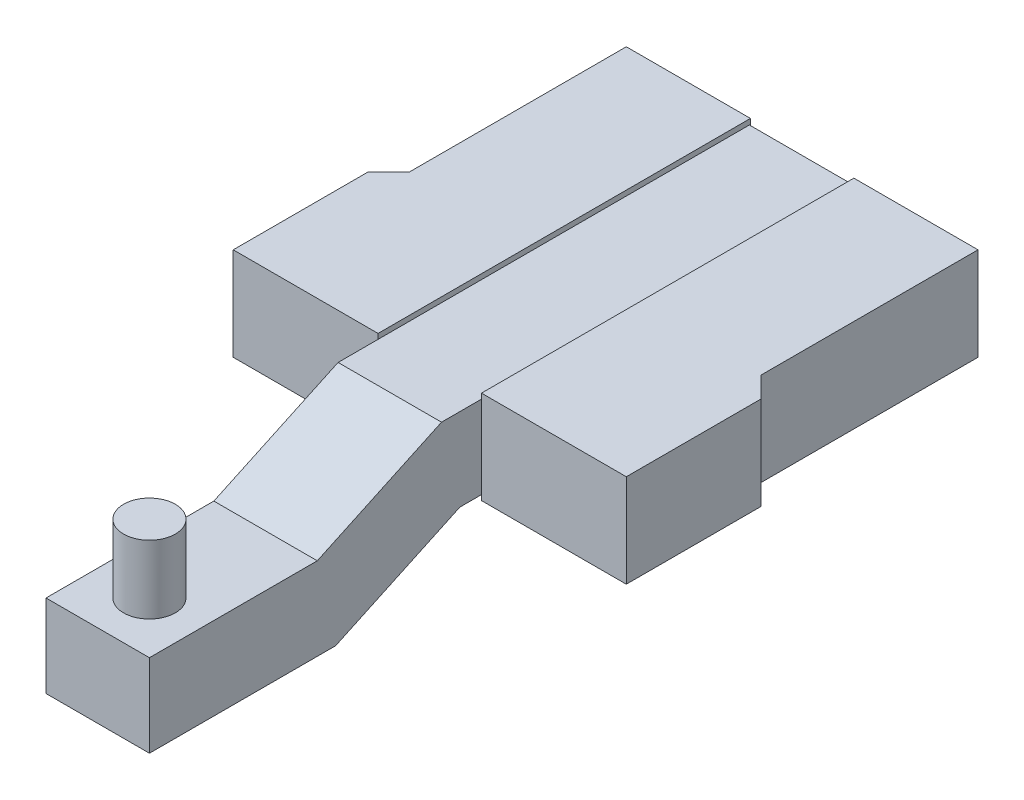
ISO-10303-21;
HEADER;
FILE_DESCRIPTION(('STEP AP214'),'2;1');
FILE_NAME('part.step','',(''),(''),'','','');
FILE_SCHEMA(('AUTOMOTIVE_DESIGN { 1 0 10303 214 1 1 1 1 }'));
ENDSEC;
DATA;
#1=APPLICATION_CONTEXT('core data for automotive mechanical design processes');
#2=APPLICATION_PROTOCOL_DEFINITION('international standard','automotive_design',2000,#1);
#3=PRODUCT_CONTEXT('',#1,'mechanical');
#4=PRODUCT('Part','Part','',(#3));
#5=PRODUCT_RELATED_PRODUCT_CATEGORY('part','',(#4));
#6=PRODUCT_DEFINITION_FORMATION('','',#4);
#7=PRODUCT_DEFINITION_CONTEXT('part definition',#1,'design');
#8=PRODUCT_DEFINITION('design','',#6,#7);
#9=PRODUCT_DEFINITION_SHAPE('','',#8);
#10=(LENGTH_UNIT() NAMED_UNIT(*) SI_UNIT(.MILLI.,.METRE.));
#11=(NAMED_UNIT(*) PLANE_ANGLE_UNIT() SI_UNIT($,.RADIAN.));
#12=(NAMED_UNIT(*) SI_UNIT($,.STERADIAN.) SOLID_ANGLE_UNIT());
#13=UNCERTAINTY_MEASURE_WITH_UNIT(LENGTH_MEASURE(1.E-05),#10,'distance_accuracy_value','');
#14=(GEOMETRIC_REPRESENTATION_CONTEXT(3) GLOBAL_UNCERTAINTY_ASSIGNED_CONTEXT((#13)) GLOBAL_UNIT_ASSIGNED_CONTEXT((#10,
#11,#12)) REPRESENTATION_CONTEXT('',''));
#15=CARTESIAN_POINT('',(0.,0.,0.));
#16=DIRECTION('',(0.,0.,1.));
#17=DIRECTION('',(1.,0.,0.));
#18=AXIS2_PLACEMENT_3D('',#15,#16,#17);
#19=CARTESIAN_POINT('',(25.,40.,-100.));
#20=DIRECTION('',(0.,-1.,0.));
#21=DIRECTION('',(0.,0.,-1.));
#22=AXIS2_PLACEMENT_3D('',#19,#20,#21);
#23=PLANE('',#22);
#24=DIRECTION('',(-1.,0.,0.));
#25=VECTOR('',#24,1.);
#26=CARTESIAN_POINT('',(25.,40.,-181.132213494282));
#27=LINE('',#26,#25);
#28=CARTESIAN_POINT('',(25.,40.,-181.132213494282));
#29=VERTEX_POINT('',#28);
#30=CARTESIAN_POINT('',(-25.,40.,-181.132213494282));
#31=VERTEX_POINT('',#30);
#32=EDGE_CURVE('E317',#29,#31,#27,.T.);
#33=ORIENTED_EDGE('',*,*,#32,.T.);
#34=DIRECTION('',(0.,0.,1.));
#35=VECTOR('',#34,1.);
#36=CARTESIAN_POINT('',(-25.,40.,-100.));
#37=LINE('',#36,#35);
#38=CARTESIAN_POINT('',(-25.,40.,-100.));
#39=VERTEX_POINT('',#38);
#40=EDGE_CURVE('E270',#31,#39,#37,.T.);
#41=ORIENTED_EDGE('',*,*,#40,.T.);
#42=DIRECTION('',(-1.,0.,0.));
#43=VECTOR('',#42,1.);
#44=CARTESIAN_POINT('',(25.,40.,-100.));
#45=LINE('',#44,#43);
#46=CARTESIAN_POINT('',(25.,40.,-100.));
#47=VERTEX_POINT('',#46);
#48=EDGE_CURVE('E333',#47,#39,#45,.T.);
#49=ORIENTED_EDGE('',*,*,#48,.F.);
#50=DIRECTION('',(0.,0.,1.));
#51=VECTOR('',#50,1.);
#52=CARTESIAN_POINT('',(25.,40.,-100.));
#53=LINE('',#52,#51);
#54=EDGE_CURVE('E296',#29,#47,#53,.T.);
#55=ORIENTED_EDGE('',*,*,#54,.F.);
#56=EDGE_LOOP('',(#33,#41,#49,#55));
#57=FACE_BOUND('',#56,.T.);
#58=CARTESIAN_POINT('',(0.,40.,-125.));
#59=DIRECTION('',(0.,-1.,0.));
#60=DIRECTION('',(0.,0.,-1.));
#61=AXIS2_PLACEMENT_3D('',#58,#59,#60);
#62=CIRCLE('',#61,12.4999999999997);
#63=CARTESIAN_POINT('',(0.,40.,-137.5));
#64=VERTEX_POINT('',#63);
#65=EDGE_CURVE('E10',#64,#64,#62,.F.);
#66=ORIENTED_EDGE('',*,*,#65,.F.);
#67=EDGE_LOOP('',(#66));
#68=FACE_BOUND('',#67,.T.);
#69=ADVANCED_FACE('F15',(#57,#68),#23,.F.);
#70=CARTESIAN_POINT('',(25.,40.,-440.));
#71=DIRECTION('',(-1.,0.,0.));
#72=DIRECTION('',(0.,0.,1.));
#73=AXIS2_PLACEMENT_3D('',#70,#71,#72);
#74=PLANE('',#73);
#75=DIRECTION('',(0.,-1.,0.));
#76=VECTOR('',#75,1.);
#77=CARTESIAN_POINT('',(25.,70.5,-260.5));
#78=LINE('',#77,#76);
#79=CARTESIAN_POINT('',(25.,68.,-260.5));
#80=VERTEX_POINT('',#79);
#81=CARTESIAN_POINT('',(25.,28.,-260.5));
#82=VERTEX_POINT('',#81);
#83=EDGE_CURVE('E22',#80,#82,#78,.T.);
#84=ORIENTED_EDGE('',*,*,#83,.F.);
#85=DIRECTION('',(0.,0.,1.));
#86=VECTOR('',#85,1.);
#87=CARTESIAN_POINT('',(25.,68.,-241.178407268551));
#88=LINE('',#87,#86);
#89=CARTESIAN_POINT('',(25.,68.,-241.178407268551));
#90=VERTEX_POINT('',#89);
#91=EDGE_CURVE('E311',#80,#90,#88,.T.);
#92=ORIENTED_EDGE('',*,*,#91,.T.);
#93=DIRECTION('',(0.,-0.422618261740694,0.906307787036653));
#94=VECTOR('',#93,1.);
#95=CARTESIAN_POINT('',(25.,40.,-181.132213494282));
#96=LINE('',#95,#94);
#97=EDGE_CURVE('E315',#90,#29,#96,.T.);
#98=ORIENTED_EDGE('',*,*,#97,.T.);
#99=ORIENTED_EDGE('',*,*,#54,.T.);
#100=DIRECTION('',(0.,-1.,0.));
#101=VECTOR('',#100,1.);
#102=CARTESIAN_POINT('',(25.,40.,-100.));
#103=LINE('',#102,#101);
#104=CARTESIAN_POINT('',(25.,0.,-100.));
#105=VERTEX_POINT('',#104);
#106=EDGE_CURVE('E299',#47,#105,#103,.T.);
#107=ORIENTED_EDGE('',*,*,#106,.T.);
#108=DIRECTION('',(0.,0.,-1.));
#109=VECTOR('',#108,1.);
#110=CARTESIAN_POINT('',(25.,0.,-100.));
#111=LINE('',#110,#109);
#112=CARTESIAN_POINT('',(25.,0.,-190.));
#113=VERTEX_POINT('',#112);
#114=EDGE_CURVE('E301',#105,#113,#111,.T.);
#115=ORIENTED_EDGE('',*,*,#114,.T.);
#116=DIRECTION('',(0.,0.422618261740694,-0.906307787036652));
#117=VECTOR('',#116,1.);
#118=CARTESIAN_POINT('',(25.,28.,-250.046193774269));
#119=LINE('',#118,#117);
#120=CARTESIAN_POINT('',(25.,28.,-250.046193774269));
#121=VERTEX_POINT('',#120);
#122=EDGE_CURVE('E303',#113,#121,#119,.T.);
#123=ORIENTED_EDGE('',*,*,#122,.T.);
#124=DIRECTION('',(0.,0.,-1.));
#125=VECTOR('',#124,1.);
#126=CARTESIAN_POINT('',(25.,28.,-440.));
#127=LINE('',#126,#125);
#128=EDGE_CURVE('E306',#121,#82,#127,.T.);
#129=ORIENTED_EDGE('',*,*,#128,.T.);
#130=EDGE_LOOP('',(#84,#92,#98,#99,#107,#115,#123,#129));
#131=FACE_BOUND('',#130,.T.);
#132=ADVANCED_FACE('F386',(#131),#74,.F.);
#133=CARTESIAN_POINT('',(-25.,40.,-440.));
#134=DIRECTION('',(-1.,0.,0.));
#135=DIRECTION('',(0.,0.,1.));
#136=AXIS2_PLACEMENT_3D('',#133,#134,#135);
#137=PLANE('',#136);
#138=DIRECTION('',(0.,0.,1.));
#139=VECTOR('',#138,1.);
#140=CARTESIAN_POINT('',(-25.,68.,-241.178407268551));
#141=LINE('',#140,#139);
#142=CARTESIAN_POINT('',(-25.,68.,-260.5));
#143=VERTEX_POINT('',#142);
#144=CARTESIAN_POINT('',(-25.,68.,-241.178407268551));
#145=VERTEX_POINT('',#144);
#146=EDGE_CURVE('E289',#143,#145,#141,.T.);
#147=ORIENTED_EDGE('',*,*,#146,.F.);
#148=DIRECTION('',(0.,-1.,0.));
#149=VECTOR('',#148,1.);
#150=CARTESIAN_POINT('',(-25.,70.5,-260.5));
#151=LINE('',#150,#149);
#152=CARTESIAN_POINT('',(-25.,28.,-260.5));
#153=VERTEX_POINT('',#152);
#154=EDGE_CURVE('E262',#143,#153,#151,.T.);
#155=ORIENTED_EDGE('',*,*,#154,.T.);
#156=DIRECTION('',(0.,0.,-1.));
#157=VECTOR('',#156,1.);
#158=CARTESIAN_POINT('',(-25.,28.,-440.));
#159=LINE('',#158,#157);
#160=CARTESIAN_POINT('',(-25.,28.,-250.046193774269));
#161=VERTEX_POINT('',#160);
#162=EDGE_CURVE('E283',#161,#153,#159,.T.);
#163=ORIENTED_EDGE('',*,*,#162,.F.);
#164=DIRECTION('',(0.,0.422618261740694,-0.906307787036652));
#165=VECTOR('',#164,1.);
#166=CARTESIAN_POINT('',(-25.,28.,-250.046193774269));
#167=LINE('',#166,#165);
#168=CARTESIAN_POINT('',(-25.,0.,-190.));
#169=VERTEX_POINT('',#168);
#170=EDGE_CURVE('E279',#169,#161,#167,.T.);
#171=ORIENTED_EDGE('',*,*,#170,.F.);
#172=DIRECTION('',(0.,0.,-1.));
#173=VECTOR('',#172,1.);
#174=CARTESIAN_POINT('',(-25.,0.,-100.));
#175=LINE('',#174,#173);
#176=CARTESIAN_POINT('',(-25.,0.,-100.));
#177=VERTEX_POINT('',#176);
#178=EDGE_CURVE('E276',#177,#169,#175,.T.);
#179=ORIENTED_EDGE('',*,*,#178,.F.);
#180=DIRECTION('',(0.,-1.,0.));
#181=VECTOR('',#180,1.);
#182=CARTESIAN_POINT('',(-25.,40.,-100.));
#183=LINE('',#182,#181);
#184=EDGE_CURVE('E273',#39,#177,#183,.T.);
#185=ORIENTED_EDGE('',*,*,#184,.F.);
#186=ORIENTED_EDGE('',*,*,#40,.F.);
#187=DIRECTION('',(0.,-0.422618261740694,0.906307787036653));
#188=VECTOR('',#187,1.);
#189=CARTESIAN_POINT('',(-25.,40.,-181.132213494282));
#190=LINE('',#189,#188);
#191=EDGE_CURVE('E293',#145,#31,#190,.T.);
#192=ORIENTED_EDGE('',*,*,#191,.F.);
#193=EDGE_LOOP('',(#147,#155,#163,#171,#179,#185,#186,#192));
#194=FACE_BOUND('',#193,.T.);
#195=ADVANCED_FACE('F392',(#194),#137,.T.);
#196=CARTESIAN_POINT('',(25.,40.,-100.));
#197=DIRECTION('',(0.,0.,-1.));
#198=DIRECTION('',(0.,1.,0.));
#199=AXIS2_PLACEMENT_3D('',#196,#197,#198);
#200=PLANE('',#199);
#201=ORIENTED_EDGE('',*,*,#48,.T.);
#202=ORIENTED_EDGE('',*,*,#184,.T.);
#203=DIRECTION('',(-1.,0.,0.));
#204=VECTOR('',#203,1.);
#205=CARTESIAN_POINT('',(25.,0.,-100.));
#206=LINE('',#205,#204);
#207=EDGE_CURVE('E332',#105,#177,#206,.T.);
#208=ORIENTED_EDGE('',*,*,#207,.F.);
#209=ORIENTED_EDGE('',*,*,#106,.F.);
#210=EDGE_LOOP('',(#201,#202,#208,#209));
#211=FACE_BOUND('',#210,.T.);
#212=ADVANCED_FACE('F619',(#211),#200,.F.);
#213=CARTESIAN_POINT('',(25.,0.,-100.));
#214=DIRECTION('',(0.,1.,0.));
#215=DIRECTION('',(0.,0.,1.));
#216=AXIS2_PLACEMENT_3D('',#213,#214,#215);
#217=PLANE('',#216);
#218=ORIENTED_EDGE('',*,*,#207,.T.);
#219=ORIENTED_EDGE('',*,*,#178,.T.);
#220=DIRECTION('',(-1.,0.,0.));
#221=VECTOR('',#220,1.);
#222=CARTESIAN_POINT('',(25.,0.,-190.));
#223=LINE('',#222,#221);
#224=EDGE_CURVE('E330',#113,#169,#223,.T.);
#225=ORIENTED_EDGE('',*,*,#224,.F.);
#226=ORIENTED_EDGE('',*,*,#114,.F.);
#227=EDGE_LOOP('',(#218,#219,#225,#226));
#228=FACE_BOUND('',#227,.T.);
#229=ADVANCED_FACE('F610',(#228),#217,.F.);
#230=CARTESIAN_POINT('',(25.,28.,-250.046193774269));
#231=DIRECTION('',(0.,0.906307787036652,0.422618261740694));
#232=DIRECTION('',(0.,-0.422618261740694,0.906307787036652));
#233=AXIS2_PLACEMENT_3D('',#230,#231,#232);
#234=PLANE('',#233);
#235=ORIENTED_EDGE('',*,*,#224,.T.);
#236=ORIENTED_EDGE('',*,*,#170,.T.);
#237=DIRECTION('',(-1.,0.,0.));
#238=VECTOR('',#237,1.);
#239=CARTESIAN_POINT('',(25.,28.,-250.046193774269));
#240=LINE('',#239,#238);
#241=EDGE_CURVE('E328',#121,#161,#240,.T.);
#242=ORIENTED_EDGE('',*,*,#241,.F.);
#243=ORIENTED_EDGE('',*,*,#122,.F.);
#244=EDGE_LOOP('',(#235,#236,#242,#243));
#245=FACE_BOUND('',#244,.T.);
#246=ADVANCED_FACE('F601',(#245),#234,.F.);
#247=CARTESIAN_POINT('',(25.,28.,-440.));
#248=DIRECTION('',(0.,1.,0.));
#249=DIRECTION('',(0.,0.,1.));
#250=AXIS2_PLACEMENT_3D('',#247,#248,#249);
#251=PLANE('',#250);
#252=ORIENTED_EDGE('',*,*,#241,.T.);
#253=ORIENTED_EDGE('',*,*,#162,.T.);
#254=CARTESIAN_POINT('',(-25.,28.,-440.));
#255=VERTEX_POINT('',#254);
#256=EDGE_CURVE('E282',#153,#255,#159,.T.);
#257=ORIENTED_EDGE('',*,*,#256,.T.);
#258=DIRECTION('',(-1.,0.,0.));
#259=VECTOR('',#258,1.);
#260=CARTESIAN_POINT('',(25.,28.,-440.));
#261=LINE('',#260,#259);
#262=CARTESIAN_POINT('',(25.,28.,-440.));
#263=VERTEX_POINT('',#262);
#264=EDGE_CURVE('E325',#263,#255,#261,.T.);
#265=ORIENTED_EDGE('',*,*,#264,.F.);
#266=EDGE_CURVE('E305',#82,#263,#127,.T.);
#267=ORIENTED_EDGE('',*,*,#266,.F.);
#268=ORIENTED_EDGE('',*,*,#128,.F.);
#269=EDGE_LOOP('',(#252,#253,#257,#265,#267,#268));
#270=FACE_BOUND('',#269,.T.);
#271=ADVANCED_FACE('F592',(#270),#251,.F.);
#272=CARTESIAN_POINT('',(25.,68.,-440.));
#273=DIRECTION('',(0.,0.,1.));
#274=DIRECTION('',(1.,0.,0.));
#275=AXIS2_PLACEMENT_3D('',#272,#273,#274);
#276=PLANE('',#275);
#277=ORIENTED_EDGE('',*,*,#264,.T.);
#278=DIRECTION('',(0.,1.,0.));
#279=VECTOR('',#278,1.);
#280=CARTESIAN_POINT('',(-25.,68.,-440.));
#281=LINE('',#280,#279);
#282=CARTESIAN_POINT('',(-25.,68.,-440.));
#283=VERTEX_POINT('',#282);
#284=EDGE_CURVE('E286',#255,#283,#281,.T.);
#285=ORIENTED_EDGE('',*,*,#284,.T.);
#286=DIRECTION('',(-1.,0.,0.));
#287=VECTOR('',#286,1.);
#288=CARTESIAN_POINT('',(25.,68.,-440.));
#289=LINE('',#288,#287);
#290=CARTESIAN_POINT('',(25.,68.,-440.));
#291=VERTEX_POINT('',#290);
#292=EDGE_CURVE('E322',#291,#283,#289,.T.);
#293=ORIENTED_EDGE('',*,*,#292,.F.);
#294=DIRECTION('',(0.,1.,0.));
#295=VECTOR('',#294,1.);
#296=CARTESIAN_POINT('',(25.,68.,-440.));
#297=LINE('',#296,#295);
#298=EDGE_CURVE('E308',#263,#291,#297,.T.);
#299=ORIENTED_EDGE('',*,*,#298,.F.);
#300=EDGE_LOOP('',(#277,#285,#293,#299));
#301=FACE_BOUND('',#300,.T.);
#302=ADVANCED_FACE('F583',(#301),#276,.F.);
#303=CARTESIAN_POINT('',(25.,68.,-241.178407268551));
#304=DIRECTION('',(0.,-1.,0.));
#305=DIRECTION('',(0.,0.,-1.));
#306=AXIS2_PLACEMENT_3D('',#303,#304,#305);
#307=PLANE('',#306);
#308=ORIENTED_EDGE('',*,*,#292,.T.);
#309=EDGE_CURVE('E290',#283,#143,#141,.T.);
#310=ORIENTED_EDGE('',*,*,#309,.T.);
#311=ORIENTED_EDGE('',*,*,#146,.T.);
#312=DIRECTION('',(-1.,0.,0.));
#313=VECTOR('',#312,1.);
#314=CARTESIAN_POINT('',(25.,68.,-241.178407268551));
#315=LINE('',#314,#313);
#316=EDGE_CURVE('E319',#90,#145,#315,.T.);
#317=ORIENTED_EDGE('',*,*,#316,.F.);
#318=ORIENTED_EDGE('',*,*,#91,.F.);
#319=EDGE_CURVE('E312',#291,#80,#88,.T.);
#320=ORIENTED_EDGE('',*,*,#319,.F.);
#321=EDGE_LOOP('',(#308,#310,#311,#317,#318,#320));
#322=FACE_BOUND('',#321,.T.);
#323=ADVANCED_FACE('F575',(#322),#307,.F.);
#324=CARTESIAN_POINT('',(25.,40.,-181.132213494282));
#325=DIRECTION('',(0.,-0.906307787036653,-0.422618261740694));
#326=DIRECTION('',(0.,0.422618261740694,-0.906307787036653));
#327=AXIS2_PLACEMENT_3D('',#324,#325,#326);
#328=PLANE('',#327);
#329=ORIENTED_EDGE('',*,*,#316,.T.);
#330=ORIENTED_EDGE('',*,*,#191,.T.);
#331=ORIENTED_EDGE('',*,*,#32,.F.);
#332=ORIENTED_EDGE('',*,*,#97,.F.);
#333=EDGE_LOOP('',(#329,#330,#331,#332));
#334=FACE_BOUND('',#333,.T.);
#335=ADVANCED_FACE('F383',(#334),#328,.F.);
#336=CARTESIAN_POINT('',(-25.,70.5,-440.5));
#337=DIRECTION('',(0.,0.,1.));
#338=DIRECTION('',(1.,0.,0.));
#339=AXIS2_PLACEMENT_3D('',#336,#337,#338);
#340=PLANE('',#339);
#341=DIRECTION('',(0.,-1.,0.));
#342=VECTOR('',#341,1.);
#343=CARTESIAN_POINT('',(-25.,70.5,-440.5));
#344=LINE('',#343,#342);
#345=CARTESIAN_POINT('',(-25.,70.5,-440.5));
#346=VERTEX_POINT('',#345);
#347=CARTESIAN_POINT('',(-25.,25.5,-440.5));
#348=VERTEX_POINT('',#347);
#349=EDGE_CURVE('E256',#346,#348,#344,.T.);
#350=ORIENTED_EDGE('',*,*,#349,.T.);
#351=DIRECTION('',(-1.,0.,0.));
#352=VECTOR('',#351,1.);
#353=CARTESIAN_POINT('',(-25.,25.5,-440.5));
#354=LINE('',#353,#352);
#355=CARTESIAN_POINT('',(-85.,25.5,-440.5));
#356=VERTEX_POINT('',#355);
#357=EDGE_CURVE('E173',#348,#356,#354,.T.);
#358=ORIENTED_EDGE('',*,*,#357,.T.);
#359=DIRECTION('',(0.,-1.,0.));
#360=VECTOR('',#359,1.);
#361=CARTESIAN_POINT('',(-85.,70.5,-440.5));
#362=LINE('',#361,#360);
#363=CARTESIAN_POINT('',(-85.,70.5,-440.5));
#364=VERTEX_POINT('',#363);
#365=EDGE_CURVE('E268',#364,#356,#362,.T.);
#366=ORIENTED_EDGE('',*,*,#365,.F.);
#367=DIRECTION('',(-1.,0.,0.));
#368=VECTOR('',#367,1.);
#369=CARTESIAN_POINT('',(-25.,70.5,-440.5));
#370=LINE('',#369,#368);
#371=EDGE_CURVE('E243',#346,#364,#370,.T.);
#372=ORIENTED_EDGE('',*,*,#371,.F.);
#373=EDGE_LOOP('',(#350,#358,#366,#372));
#374=FACE_BOUND('',#373,.T.);
#375=ADVANCED_FACE('F358',(#374),#340,.F.);
#376=CARTESIAN_POINT('',(-85.,70.5,-440.5));
#377=DIRECTION('',(1.,0.,0.));
#378=DIRECTION('',(0.,0.,-1.));
#379=AXIS2_PLACEMENT_3D('',#376,#377,#378);
#380=PLANE('',#379);
#381=ORIENTED_EDGE('',*,*,#365,.T.);
#382=DIRECTION('',(0.,0.,1.));
#383=VECTOR('',#382,1.);
#384=CARTESIAN_POINT('',(-85.,25.5,-440.5));
#385=LINE('',#384,#383);
#386=CARTESIAN_POINT('',(-85.,25.5,-335.5));
#387=VERTEX_POINT('',#386);
#388=EDGE_CURVE('E229',#356,#387,#385,.T.);
#389=ORIENTED_EDGE('',*,*,#388,.T.);
#390=DIRECTION('',(0.,-1.,0.));
#391=VECTOR('',#390,1.);
#392=CARTESIAN_POINT('',(-85.,70.5,-335.5));
#393=LINE('',#392,#391);
#394=CARTESIAN_POINT('',(-85.,70.5,-335.5));
#395=VERTEX_POINT('',#394);
#396=EDGE_CURVE('E266',#395,#387,#393,.T.);
#397=ORIENTED_EDGE('',*,*,#396,.F.);
#398=DIRECTION('',(0.,0.,1.));
#399=VECTOR('',#398,1.);
#400=CARTESIAN_POINT('',(-85.,70.5,-440.5));
#401=LINE('',#400,#399);
#402=EDGE_CURVE('E246',#364,#395,#401,.T.);
#403=ORIENTED_EDGE('',*,*,#402,.F.);
#404=EDGE_LOOP('',(#381,#389,#397,#403));
#405=FACE_BOUND('',#404,.T.);
#406=ADVANCED_FACE('F373',(#405),#380,.F.);
#407=CARTESIAN_POINT('',(-85.,70.5,-335.5));
#408=DIRECTION('',(0.707106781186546,0.,0.70710678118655));
#409=DIRECTION('',(0.70710678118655,0.,-0.707106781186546));
#410=AXIS2_PLACEMENT_3D('',#407,#408,#409);
#411=PLANE('',#410);
#412=ORIENTED_EDGE('',*,*,#396,.T.);
#413=DIRECTION('',(-0.70710678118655,0.,0.707106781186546));
#414=VECTOR('',#413,1.);
#415=CARTESIAN_POINT('',(-85.,25.5,-335.5));
#416=LINE('',#415,#414);
#417=CARTESIAN_POINT('',(-95.,25.5,-325.5));
#418=VERTEX_POINT('',#417);
#419=EDGE_CURVE('E232',#387,#418,#416,.T.);
#420=ORIENTED_EDGE('',*,*,#419,.T.);
#421=DIRECTION('',(0.,-1.,0.));
#422=VECTOR('',#421,1.);
#423=CARTESIAN_POINT('',(-95.,70.5,-325.5));
#424=LINE('',#423,#422);
#425=CARTESIAN_POINT('',(-95.,70.5,-325.5));
#426=VERTEX_POINT('',#425);
#427=EDGE_CURVE('E264',#426,#418,#424,.T.);
#428=ORIENTED_EDGE('',*,*,#427,.F.);
#429=DIRECTION('',(-0.70710678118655,0.,0.707106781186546));
#430=VECTOR('',#429,1.);
#431=CARTESIAN_POINT('',(-85.,70.5,-335.5));
#432=LINE('',#431,#430);
#433=EDGE_CURVE('E248',#395,#426,#432,.T.);
#434=ORIENTED_EDGE('',*,*,#433,.F.);
#435=EDGE_LOOP('',(#412,#420,#428,#434));
#436=FACE_BOUND('',#435,.T.);
#437=ADVANCED_FACE('F370',(#436),#411,.F.);
#438=CARTESIAN_POINT('',(-95.,70.5,-325.5));
#439=DIRECTION('',(1.,0.,0.));
#440=DIRECTION('',(0.,0.,-1.));
#441=AXIS2_PLACEMENT_3D('',#438,#439,#440);
#442=PLANE('',#441);
#443=ORIENTED_EDGE('',*,*,#427,.T.);
#444=DIRECTION('',(0.,0.,1.));
#445=VECTOR('',#444,1.);
#446=CARTESIAN_POINT('',(-95.,25.5,-325.5));
#447=LINE('',#446,#445);
#448=CARTESIAN_POINT('',(-95.,25.5,-260.5));
#449=VERTEX_POINT('',#448);
#450=EDGE_CURVE('E235',#418,#449,#447,.T.);
#451=ORIENTED_EDGE('',*,*,#450,.T.);
#452=DIRECTION('',(0.,-1.,0.));
#453=VECTOR('',#452,1.);
#454=CARTESIAN_POINT('',(-95.,70.5,-260.5));
#455=LINE('',#454,#453);
#456=CARTESIAN_POINT('',(-95.,70.5,-260.5));
#457=VERTEX_POINT('',#456);
#458=EDGE_CURVE('E261',#457,#449,#455,.T.);
#459=ORIENTED_EDGE('',*,*,#458,.F.);
#460=DIRECTION('',(0.,0.,1.));
#461=VECTOR('',#460,1.);
#462=CARTESIAN_POINT('',(-95.,70.5,-325.5));
#463=LINE('',#462,#461);
#464=EDGE_CURVE('E250',#426,#457,#463,.T.);
#465=ORIENTED_EDGE('',*,*,#464,.F.);
#466=EDGE_LOOP('',(#443,#451,#459,#465));
#467=FACE_BOUND('',#466,.T.);
#468=ADVANCED_FACE('F368',(#467),#442,.F.);
#469=CARTESIAN_POINT('',(-95.,70.5,-260.5));
#470=DIRECTION('',(0.,0.,-1.));
#471=DIRECTION('',(-1.,0.,0.));
#472=AXIS2_PLACEMENT_3D('',#469,#470,#471);
#473=PLANE('',#472);
#474=ORIENTED_EDGE('',*,*,#458,.T.);
#475=DIRECTION('',(1.,0.,0.));
#476=VECTOR('',#475,1.);
#477=CARTESIAN_POINT('',(-95.,25.5,-260.5));
#478=LINE('',#477,#476);
#479=CARTESIAN_POINT('',(-25.,25.5,-260.5));
#480=VERTEX_POINT('',#479);
#481=EDGE_CURVE('E238',#449,#480,#478,.T.);
#482=ORIENTED_EDGE('',*,*,#481,.T.);
#483=EDGE_CURVE('E36',#153,#480,#151,.T.);
#484=ORIENTED_EDGE('',*,*,#483,.F.);
#485=ORIENTED_EDGE('',*,*,#154,.F.);
#486=CARTESIAN_POINT('',(-25.,70.5,-260.5));
#487=VERTEX_POINT('',#486);
#488=EDGE_CURVE('E258',#487,#143,#151,.T.);
#489=ORIENTED_EDGE('',*,*,#488,.F.);
#490=DIRECTION('',(1.,0.,0.));
#491=VECTOR('',#490,1.);
#492=CARTESIAN_POINT('',(-95.,70.5,-260.5));
#493=LINE('',#492,#491);
#494=EDGE_CURVE('E252',#457,#487,#493,.T.);
#495=ORIENTED_EDGE('',*,*,#494,.F.);
#496=EDGE_LOOP('',(#474,#482,#484,#485,#489,#495));
#497=FACE_BOUND('',#496,.T.);
#498=ADVANCED_FACE('F347',(#497),#473,.F.);
#499=CARTESIAN_POINT('',(-25.,70.5,-440.5));
#500=DIRECTION('',(-1.,0.,0.));
#501=DIRECTION('',(0.,0.,1.));
#502=AXIS2_PLACEMENT_3D('',#499,#500,#501);
#503=PLANE('',#502);
#504=ORIENTED_EDGE('',*,*,#309,.F.);
#505=ORIENTED_EDGE('',*,*,#284,.F.);
#506=ORIENTED_EDGE('',*,*,#256,.F.);
#507=ORIENTED_EDGE('',*,*,#483,.T.);
#508=DIRECTION('',(0.,0.,-1.));
#509=VECTOR('',#508,1.);
#510=CARTESIAN_POINT('',(-25.,25.5,-440.5));
#511=LINE('',#510,#509);
#512=EDGE_CURVE('E240',#480,#348,#511,.T.);
#513=ORIENTED_EDGE('',*,*,#512,.T.);
#514=ORIENTED_EDGE('',*,*,#349,.F.);
#515=DIRECTION('',(0.,0.,-1.));
#516=VECTOR('',#515,1.);
#517=CARTESIAN_POINT('',(-25.,70.5,-440.5));
#518=LINE('',#517,#516);
#519=EDGE_CURVE('E254',#487,#346,#518,.T.);
#520=ORIENTED_EDGE('',*,*,#519,.F.);
#521=ORIENTED_EDGE('',*,*,#488,.T.);
#522=EDGE_LOOP('',(#504,#505,#506,#507,#513,#514,#520,#521));
#523=FACE_BOUND('',#522,.T.);
#524=ADVANCED_FACE('F342',(#523),#503,.F.);
#525=CARTESIAN_POINT('',(-25.,70.5,-440.5));
#526=DIRECTION('',(0.,1.,0.));
#527=DIRECTION('',(0.,0.,1.));
#528=AXIS2_PLACEMENT_3D('',#525,#526,#527);
#529=PLANE('',#528);
#530=ORIENTED_EDGE('',*,*,#371,.T.);
#531=ORIENTED_EDGE('',*,*,#402,.T.);
#532=ORIENTED_EDGE('',*,*,#433,.T.);
#533=ORIENTED_EDGE('',*,*,#464,.T.);
#534=ORIENTED_EDGE('',*,*,#494,.T.);
#535=ORIENTED_EDGE('',*,*,#519,.T.);
#536=EDGE_LOOP('',(#530,#531,#532,#533,#534,#535));
#537=FACE_BOUND('',#536,.T.);
#538=ADVANCED_FACE('F363',(#537),#529,.T.);
#539=CARTESIAN_POINT('',(-25.,25.5,-440.5));
#540=DIRECTION('',(0.,1.,0.));
#541=DIRECTION('',(0.,0.,1.));
#542=AXIS2_PLACEMENT_3D('',#539,#540,#541);
#543=PLANE('',#542);
#544=ORIENTED_EDGE('',*,*,#357,.F.);
#545=ORIENTED_EDGE('',*,*,#512,.F.);
#546=ORIENTED_EDGE('',*,*,#481,.F.);
#547=ORIENTED_EDGE('',*,*,#450,.F.);
#548=ORIENTED_EDGE('',*,*,#419,.F.);
#549=ORIENTED_EDGE('',*,*,#388,.F.);
#550=EDGE_LOOP('',(#544,#545,#546,#547,#548,#549));
#551=FACE_BOUND('',#550,.T.);
#552=ADVANCED_FACE('F353',(#551),#543,.F.);
#553=CARTESIAN_POINT('',(25.,70.5,-440.5));
#554=DIRECTION('',(0.,0.,-1.));
#555=DIRECTION('',(-1.,0.,0.));
#556=AXIS2_PLACEMENT_3D('',#553,#554,#555);
#557=PLANE('',#556);
#558=DIRECTION('',(0.,-1.,0.));
#559=VECTOR('',#558,1.);
#560=CARTESIAN_POINT('',(85.,70.5,-440.5));
#561=LINE('',#560,#559);
#562=CARTESIAN_POINT('',(85.,70.5,-440.5));
#563=VERTEX_POINT('',#562);
#564=CARTESIAN_POINT('',(85.,25.5,-440.5));
#565=VERTEX_POINT('',#564);
#566=EDGE_CURVE('E187',#563,#565,#561,.T.);
#567=ORIENTED_EDGE('',*,*,#566,.T.);
#568=DIRECTION('',(1.,0.,0.));
#569=VECTOR('',#568,1.);
#570=CARTESIAN_POINT('',(25.,25.5,-440.5));
#571=LINE('',#570,#569);
#572=CARTESIAN_POINT('',(25.,25.5,-440.5));
#573=VERTEX_POINT('',#572);
#574=EDGE_CURVE('E181',#573,#565,#571,.T.);
#575=ORIENTED_EDGE('',*,*,#574,.F.);
#576=DIRECTION('',(0.,-1.,0.));
#577=VECTOR('',#576,1.);
#578=CARTESIAN_POINT('',(25.,70.5,-440.5));
#579=LINE('',#578,#577);
#580=CARTESIAN_POINT('',(25.,70.5,-440.5));
#581=VERTEX_POINT('',#580);
#582=EDGE_CURVE('E162',#581,#573,#579,.T.);
#583=ORIENTED_EDGE('',*,*,#582,.F.);
#584=DIRECTION('',(1.,0.,0.));
#585=VECTOR('',#584,1.);
#586=CARTESIAN_POINT('',(25.,70.5,-440.5));
#587=LINE('',#586,#585);
#588=EDGE_CURVE('E202',#581,#563,#587,.T.);
#589=ORIENTED_EDGE('',*,*,#588,.T.);
#590=EDGE_LOOP('',(#567,#575,#583,#589));
#591=FACE_BOUND('',#590,.T.);
#592=ADVANCED_FACE('F186',(#591),#557,.T.);
#593=CARTESIAN_POINT('',(25.,70.5,-440.5));
#594=DIRECTION('',(-1.,0.,0.));
#595=DIRECTION('',(0.,0.,1.));
#596=AXIS2_PLACEMENT_3D('',#593,#594,#595);
#597=PLANE('',#596);
#598=CARTESIAN_POINT('',(25.,25.5,-260.5));
#599=VERTEX_POINT('',#598);
#600=EDGE_CURVE('E224',#82,#599,#78,.T.);
#601=ORIENTED_EDGE('',*,*,#600,.F.);
#602=ORIENTED_EDGE('',*,*,#266,.T.);
#603=ORIENTED_EDGE('',*,*,#298,.T.);
#604=ORIENTED_EDGE('',*,*,#319,.T.);
#605=CARTESIAN_POINT('',(25.,70.5,-260.5));
#606=VERTEX_POINT('',#605);
#607=EDGE_CURVE('E174',#606,#80,#78,.T.);
#608=ORIENTED_EDGE('',*,*,#607,.F.);
#609=DIRECTION('',(0.,0.,-1.));
#610=VECTOR('',#609,1.);
#611=CARTESIAN_POINT('',(25.,70.5,-440.5));
#612=LINE('',#611,#610);
#613=EDGE_CURVE('E168',#606,#581,#612,.T.);
#614=ORIENTED_EDGE('',*,*,#613,.T.);
#615=ORIENTED_EDGE('',*,*,#582,.T.);
#616=DIRECTION('',(0.,0.,-1.));
#617=VECTOR('',#616,1.);
#618=CARTESIAN_POINT('',(25.,25.5,-440.5));
#619=LINE('',#618,#617);
#620=EDGE_CURVE('E166',#599,#573,#619,.T.);
#621=ORIENTED_EDGE('',*,*,#620,.F.);
#622=EDGE_LOOP('',(#601,#602,#603,#604,#608,#614,#615,#621));
#623=FACE_BOUND('',#622,.T.);
#624=ADVANCED_FACE('F165',(#623),#597,.T.);
#625=CARTESIAN_POINT('',(95.,70.5,-260.5));
#626=DIRECTION('',(0.,0.,1.));
#627=DIRECTION('',(1.,0.,0.));
#628=AXIS2_PLACEMENT_3D('',#625,#626,#627);
#629=PLANE('',#628);
#630=ORIENTED_EDGE('',*,*,#607,.T.);
#631=ORIENTED_EDGE('',*,*,#83,.T.);
#632=ORIENTED_EDGE('',*,*,#600,.T.);
#633=DIRECTION('',(-1.,0.,0.));
#634=VECTOR('',#633,1.);
#635=CARTESIAN_POINT('',(95.,25.5,-260.5));
#636=LINE('',#635,#634);
#637=CARTESIAN_POINT('',(95.,25.5,-260.5));
#638=VERTEX_POINT('',#637);
#639=EDGE_CURVE('E184',#638,#599,#636,.T.);
#640=ORIENTED_EDGE('',*,*,#639,.F.);
#641=DIRECTION('',(0.,-1.,0.));
#642=VECTOR('',#641,1.);
#643=CARTESIAN_POINT('',(95.,70.5,-260.5));
#644=LINE('',#643,#642);
#645=CARTESIAN_POINT('',(95.,70.5,-260.5));
#646=VERTEX_POINT('',#645);
#647=EDGE_CURVE('E222',#646,#638,#644,.T.);
#648=ORIENTED_EDGE('',*,*,#647,.F.);
#649=DIRECTION('',(-1.,0.,0.));
#650=VECTOR('',#649,1.);
#651=CARTESIAN_POINT('',(95.,70.5,-260.5));
#652=LINE('',#651,#650);
#653=EDGE_CURVE('E205',#646,#606,#652,.T.);
#654=ORIENTED_EDGE('',*,*,#653,.T.);
#655=EDGE_LOOP('',(#630,#631,#632,#640,#648,#654));
#656=FACE_BOUND('',#655,.T.);
#657=ADVANCED_FACE('F430',(#656),#629,.T.);
#658=CARTESIAN_POINT('',(95.,70.5,-325.5));
#659=DIRECTION('',(1.,0.,0.));
#660=DIRECTION('',(0.,0.,-1.));
#661=AXIS2_PLACEMENT_3D('',#658,#659,#660);
#662=PLANE('',#661);
#663=ORIENTED_EDGE('',*,*,#647,.T.);
#664=DIRECTION('',(0.,0.,1.));
#665=VECTOR('',#664,1.);
#666=CARTESIAN_POINT('',(95.,25.5,-325.5));
#667=LINE('',#666,#665);
#668=CARTESIAN_POINT('',(95.,25.5,-325.5));
#669=VERTEX_POINT('',#668);
#670=EDGE_CURVE('E195',#669,#638,#667,.T.);
#671=ORIENTED_EDGE('',*,*,#670,.F.);
#672=DIRECTION('',(0.,-1.,0.));
#673=VECTOR('',#672,1.);
#674=CARTESIAN_POINT('',(95.,70.5,-325.5));
#675=LINE('',#674,#673);
#676=CARTESIAN_POINT('',(95.,70.5,-325.5));
#677=VERTEX_POINT('',#676);
#678=EDGE_CURVE('E220',#677,#669,#675,.T.);
#679=ORIENTED_EDGE('',*,*,#678,.F.);
#680=DIRECTION('',(0.,0.,1.));
#681=VECTOR('',#680,1.);
#682=CARTESIAN_POINT('',(95.,70.5,-325.5));
#683=LINE('',#682,#681);
#684=EDGE_CURVE('E208',#677,#646,#683,.T.);
#685=ORIENTED_EDGE('',*,*,#684,.T.);
#686=EDGE_LOOP('',(#663,#671,#679,#685));
#687=FACE_BOUND('',#686,.T.);
#688=ADVANCED_FACE('F426',(#687),#662,.T.);
#689=CARTESIAN_POINT('',(85.,70.5,-335.5));
#690=DIRECTION('',(0.707106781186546,0.,-0.70710678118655));
#691=DIRECTION('',(-0.70710678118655,0.,-0.707106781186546));
#692=AXIS2_PLACEMENT_3D('',#689,#690,#691);
#693=PLANE('',#692);
#694=ORIENTED_EDGE('',*,*,#678,.T.);
#695=DIRECTION('',(0.70710678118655,0.,0.707106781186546));
#696=VECTOR('',#695,1.);
#697=CARTESIAN_POINT('',(85.,25.5,-335.5));
#698=LINE('',#697,#696);
#699=CARTESIAN_POINT('',(85.,25.5,-335.5));
#700=VERTEX_POINT('',#699);
#701=EDGE_CURVE('E197',#700,#669,#698,.T.);
#702=ORIENTED_EDGE('',*,*,#701,.F.);
#703=DIRECTION('',(0.,-1.,0.));
#704=VECTOR('',#703,1.);
#705=CARTESIAN_POINT('',(85.,70.5,-335.5));
#706=LINE('',#705,#704);
#707=CARTESIAN_POINT('',(85.,70.5,-335.5));
#708=VERTEX_POINT('',#707);
#709=EDGE_CURVE('E218',#708,#700,#706,.T.);
#710=ORIENTED_EDGE('',*,*,#709,.F.);
#711=DIRECTION('',(0.70710678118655,0.,0.707106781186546));
#712=VECTOR('',#711,1.);
#713=CARTESIAN_POINT('',(85.,70.5,-335.5));
#714=LINE('',#713,#712);
#715=EDGE_CURVE('E211',#708,#677,#714,.T.);
#716=ORIENTED_EDGE('',*,*,#715,.T.);
#717=EDGE_LOOP('',(#694,#702,#710,#716));
#718=FACE_BOUND('',#717,.T.);
#719=ADVANCED_FACE('F422',(#718),#693,.T.);
#720=CARTESIAN_POINT('',(85.,70.5,-440.5));
#721=DIRECTION('',(1.,0.,0.));
#722=DIRECTION('',(0.,0.,-1.));
#723=AXIS2_PLACEMENT_3D('',#720,#721,#722);
#724=PLANE('',#723);
#725=ORIENTED_EDGE('',*,*,#709,.T.);
#726=DIRECTION('',(0.,0.,1.));
#727=VECTOR('',#726,1.);
#728=CARTESIAN_POINT('',(85.,25.5,-440.5));
#729=LINE('',#728,#727);
#730=EDGE_CURVE('E200',#565,#700,#729,.T.);
#731=ORIENTED_EDGE('',*,*,#730,.F.);
#732=ORIENTED_EDGE('',*,*,#566,.F.);
#733=DIRECTION('',(0.,0.,1.));
#734=VECTOR('',#733,1.);
#735=CARTESIAN_POINT('',(85.,70.5,-440.5));
#736=LINE('',#735,#734);
#737=EDGE_CURVE('E214',#563,#708,#736,.T.);
#738=ORIENTED_EDGE('',*,*,#737,.T.);
#739=EDGE_LOOP('',(#725,#731,#732,#738));
#740=FACE_BOUND('',#739,.T.);
#741=ADVANCED_FACE('F418',(#740),#724,.T.);
#742=CARTESIAN_POINT('',(25.,70.5,-440.5));
#743=DIRECTION('',(0.,1.,0.));
#744=DIRECTION('',(0.,0.,1.));
#745=AXIS2_PLACEMENT_3D('',#742,#743,#744);
#746=PLANE('',#745);
#747=ORIENTED_EDGE('',*,*,#588,.F.);
#748=ORIENTED_EDGE('',*,*,#613,.F.);
#749=ORIENTED_EDGE('',*,*,#653,.F.);
#750=ORIENTED_EDGE('',*,*,#684,.F.);
#751=ORIENTED_EDGE('',*,*,#715,.F.);
#752=ORIENTED_EDGE('',*,*,#737,.F.);
#753=EDGE_LOOP('',(#747,#748,#749,#750,#751,#752));
#754=FACE_BOUND('',#753,.T.);
#755=ADVANCED_FACE('F412',(#754),#746,.T.);
#756=CARTESIAN_POINT('',(25.,25.5,-440.5));
#757=DIRECTION('',(0.,1.,0.));
#758=DIRECTION('',(0.,0.,1.));
#759=AXIS2_PLACEMENT_3D('',#756,#757,#758);
#760=PLANE('',#759);
#761=ORIENTED_EDGE('',*,*,#574,.T.);
#762=ORIENTED_EDGE('',*,*,#730,.T.);
#763=ORIENTED_EDGE('',*,*,#701,.T.);
#764=ORIENTED_EDGE('',*,*,#670,.T.);
#765=ORIENTED_EDGE('',*,*,#639,.T.);
#766=ORIENTED_EDGE('',*,*,#620,.T.);
#767=EDGE_LOOP('',(#761,#762,#763,#764,#765,#766));
#768=FACE_BOUND('',#767,.T.);
#769=ADVANCED_FACE('F179',(#768),#760,.F.);
#770=CARTESIAN_POINT('',(0.,73.,-125.));
#771=DIRECTION('',(0.,-1.,0.));
#772=DIRECTION('',(0.,0.,-1.));
#773=AXIS2_PLACEMENT_3D('',#770,#771,#772);
#774=CYLINDRICAL_SURFACE('',#773,12.4999999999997);
#775=CARTESIAN_POINT('',(0.,73.,-125.));
#776=DIRECTION('',(0.,1.,0.));
#777=DIRECTION('',(0.,0.,1.));
#778=AXIS2_PLACEMENT_3D('',#775,#776,#777);
#779=CIRCLE('',#778,12.4999999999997);
#780=CARTESIAN_POINT('',(0.,73.,-112.5));
#781=VERTEX_POINT('',#780);
#782=EDGE_CURVE('E189',#781,#781,#779,.T.);
#783=ORIENTED_EDGE('',*,*,#782,.F.);
#784=EDGE_LOOP('',(#783));
#785=FACE_BOUND('',#784,.T.);
#786=ORIENTED_EDGE('',*,*,#65,.T.);
#787=EDGE_LOOP('',(#786));
#788=FACE_BOUND('',#787,.T.);
#789=ADVANCED_FACE('F400',(#785,#788),#774,.T.);
#790=CARTESIAN_POINT('',(0.,73.,-125.));
#791=DIRECTION('',(0.,1.,0.));
#792=DIRECTION('',(0.,0.,1.));
#793=AXIS2_PLACEMENT_3D('',#790,#791,#792);
#794=PLANE('',#793);
#795=ORIENTED_EDGE('',*,*,#782,.T.);
#796=EDGE_LOOP('',(#795));
#797=FACE_BOUND('',#796,.T.);
#798=ADVANCED_FACE('F402',(#797),#794,.T.);
#799=CLOSED_SHELL('',(#69,#132,#195,#212,#229,#246,#271,#302,#323,#335,#375,#406,#437,#468,#498,
#524,#538,#552,#592,#624,#657,#688,#719,#741,#755,#769,#789,#798));
#800=MANIFOLD_SOLID_BREP('B1',#799);
#801=ADVANCED_BREP_SHAPE_REPRESENTATION('',(#18,#800),#14);
#802=SHAPE_DEFINITION_REPRESENTATION(#9,#801);
ENDSEC;
END-ISO-10303-21;
